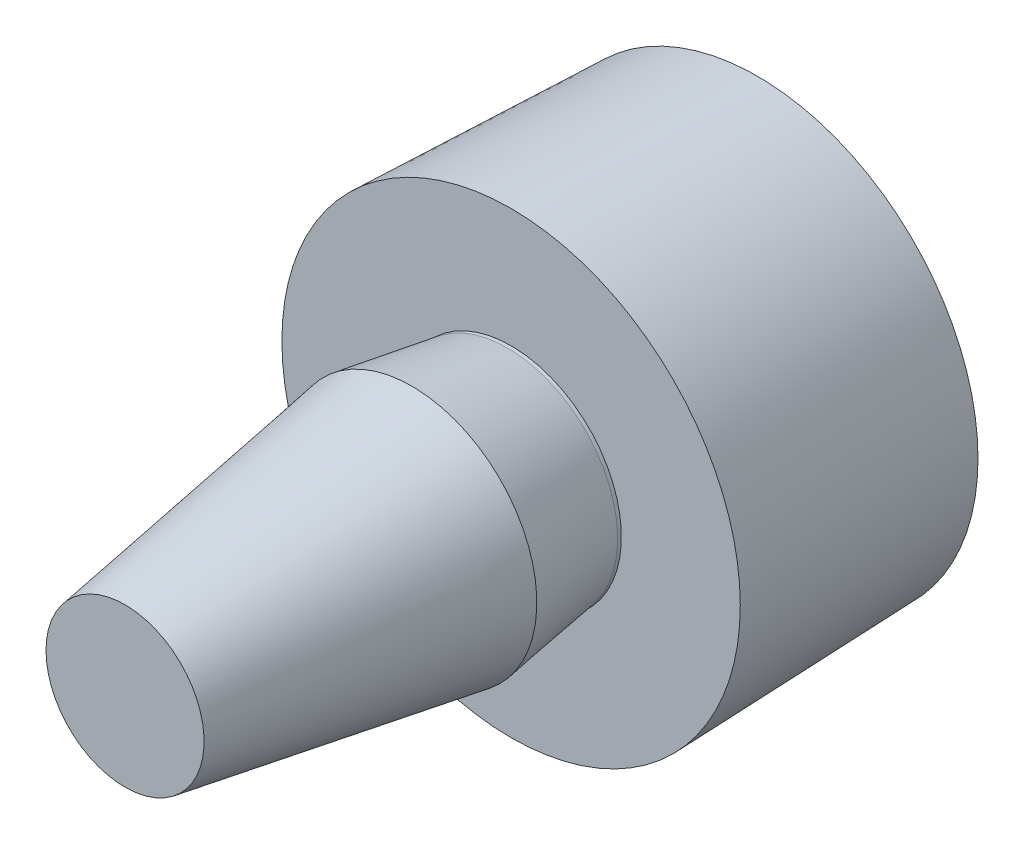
from build123d import *

# Parameters (mm, degrees)
ESQUISSE1_R         = 6
BASEEXTRUSION_DEPTH = 6.7
BASEEXTRUSION_DRAFT = -1.999999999


with BuildPart() as part:
    # Esquisse1 → BaseExtrusion (with draft: the straight prism first)
    with BuildSketch(Plane.XY):
        Circle(ESQUISSE1_R)
    extrude(amount=BASEEXTRUSION_DEPTH)
    # BaseExtrusion: the draft: its side faces are tilted about the plane it starts from
    baseextrusion_sides = [part.faces().sort_by_distance(p)[0] for p in [
        (-6, 0, 3.35),
    ]]
    draft(baseextrusion_sides, Plane.XY, BASEEXTRUSION_DRAFT)

    # Esquisse3 → Bossage-Rotation1 (revolve)
    with BuildSketch(Plane(origin=(0, 0, 0), x_dir=(0, 0, -1), z_dir=(1, 0, 0)), mode=Mode.PRIVATE) as bossage_rotation1_sk:
        Polygon((-6.7, 3), (-6.8, 3), (-9.4, 3.4), (-17.2, 2.15), (-17.2, 0), (-6.7, 0), align=None)
    revolve(bossage_rotation1_sk.sketch.rotate(Axis((0, 0, 1.964110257), (0, 0, 1)), 90), axis=Axis((0, 0, 1.964110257), (0, 0, 1)))


solid = part.part
